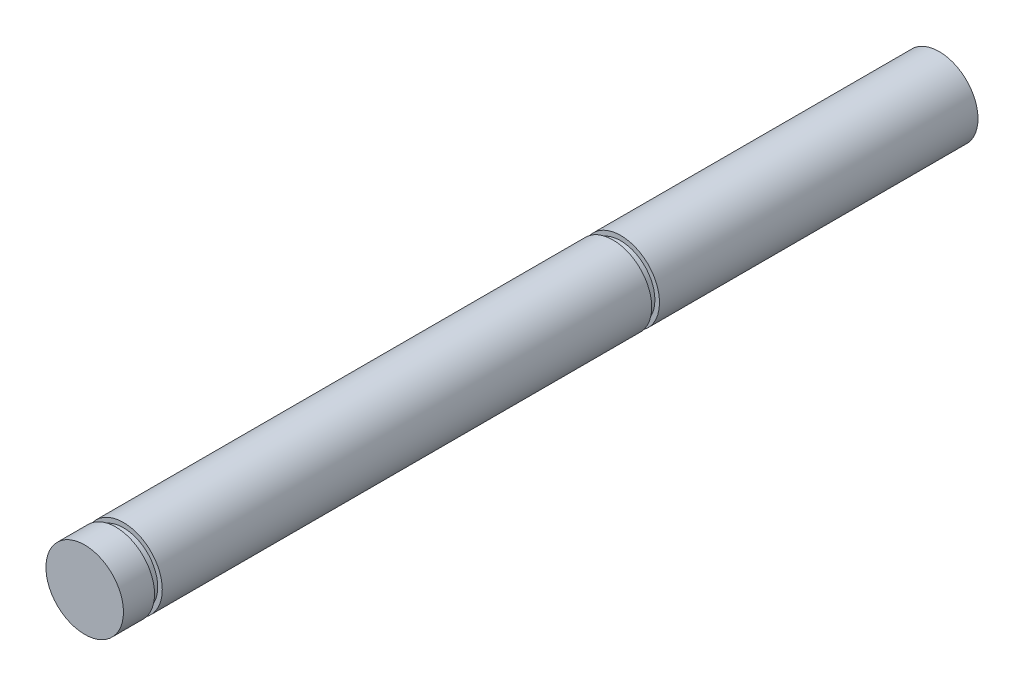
from build123d import *

# Parameters (mm, degrees)
SKETCH1_R      = 3.16865
EXTRUDE1_DEPTH = 34.925
SKETCH2_W      = 26.95758166
SKETCH2_H      = 0.635


with BuildPart() as part:
    # Sketch1 → Extrude1 (new, symmetric)
    with BuildSketch(Plane.XY):
        Circle(SKETCH1_R)
    extrude(amount=EXTRUDE1_DEPTH, both=True)

    # Sketch2 → Cut-Revolve1 (revolve, cut)
    with BuildSketch(Plane(origin=(0, 0, 0), x_dir=(1, 0, 0), z_dir=(0, 1, 0))):
        with Locations((16.27279083, 8.5725)):
            Rectangle(SKETCH2_W, SKETCH2_H)
        Polygon((2.794, -31.75), (2.794, -32.385), (29.75158166, -32.385), (29.75158166, -31.877), align=None)
    revolve(axis=Axis((0, 0, 0), (0, 0, -1)), mode=Mode.SUBTRACT)


solid = part.part
